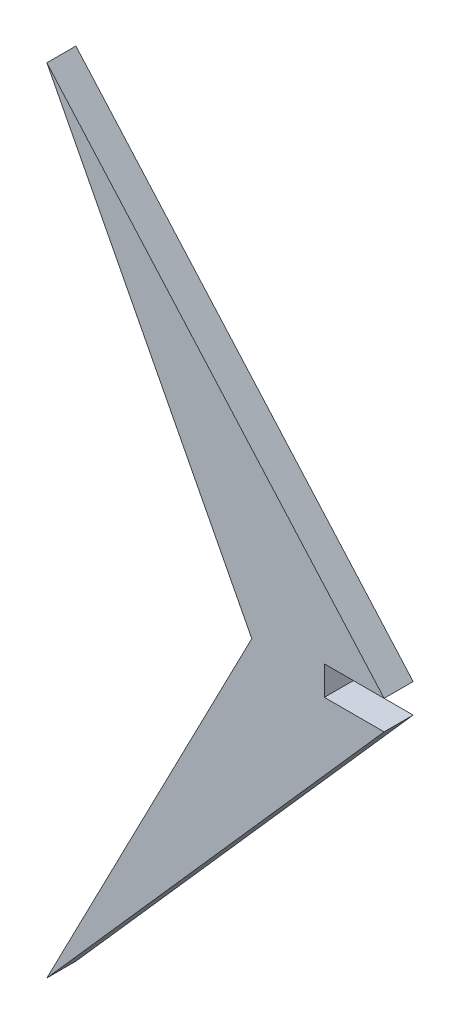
ISO-10303-21;
HEADER;
FILE_DESCRIPTION(('STEP AP214'),'2;1');
FILE_NAME('part.step','',(''),(''),'','','');
FILE_SCHEMA(('AUTOMOTIVE_DESIGN { 1 0 10303 214 1 1 1 1 }'));
ENDSEC;
DATA;
#1=APPLICATION_CONTEXT('core data for automotive mechanical design processes');
#2=APPLICATION_PROTOCOL_DEFINITION('international standard','automotive_design',2000,#1);
#3=PRODUCT_CONTEXT('',#1,'mechanical');
#4=PRODUCT('Part','Part','',(#3));
#5=PRODUCT_RELATED_PRODUCT_CATEGORY('part','',(#4));
#6=PRODUCT_DEFINITION_FORMATION('','',#4);
#7=PRODUCT_DEFINITION_CONTEXT('part definition',#1,'design');
#8=PRODUCT_DEFINITION('design','',#6,#7);
#9=PRODUCT_DEFINITION_SHAPE('','',#8);
#10=(LENGTH_UNIT() NAMED_UNIT(*) SI_UNIT(.MILLI.,.METRE.));
#11=(NAMED_UNIT(*) PLANE_ANGLE_UNIT() SI_UNIT($,.RADIAN.));
#12=(NAMED_UNIT(*) SI_UNIT($,.STERADIAN.) SOLID_ANGLE_UNIT());
#13=UNCERTAINTY_MEASURE_WITH_UNIT(LENGTH_MEASURE(1.E-05),#10,'distance_accuracy_value','');
#14=(GEOMETRIC_REPRESENTATION_CONTEXT(3) GLOBAL_UNCERTAINTY_ASSIGNED_CONTEXT((#13)) GLOBAL_UNIT_ASSIGNED_CONTEXT((#10,
#11,#12)) REPRESENTATION_CONTEXT('',''));
#15=CARTESIAN_POINT('',(0.,0.,0.));
#16=DIRECTION('',(0.,0.,1.));
#17=DIRECTION('',(1.,0.,0.));
#18=AXIS2_PLACEMENT_3D('',#15,#16,#17);
#19=CARTESIAN_POINT('',(212.350028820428,103.,6.));
#20=DIRECTION('',(-0.74947678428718,-0.662030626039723,0.));
#21=DIRECTION('',(0.662030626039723,-0.74947678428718,0.));
#22=AXIS2_PLACEMENT_3D('',#19,#20,#21);
#23=PLANE('',#22);
#24=DIRECTION('',(-0.662030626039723,0.74947678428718,0.));
#25=VECTOR('',#24,1.);
#26=CARTESIAN_POINT('',(212.350028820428,103.,0.));
#27=LINE('',#26,#25);
#28=CARTESIAN_POINT('',(212.350028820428,103.,0.));
#29=VERTEX_POINT('',#28);
#30=CARTESIAN_POINT('',(142.642356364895,181.915204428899,0.));
#31=VERTEX_POINT('',#30);
#32=EDGE_CURVE('E123',#29,#31,#27,.T.);
#33=ORIENTED_EDGE('',*,*,#32,.T.);
#34=DIRECTION('',(0.,0.,-1.));
#35=VECTOR('',#34,1.);
#36=CARTESIAN_POINT('',(142.642356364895,181.915204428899,6.));
#37=LINE('',#36,#35);
#38=CARTESIAN_POINT('',(142.642356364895,181.915204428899,6.));
#39=VERTEX_POINT('',#38);
#40=EDGE_CURVE('E11',#39,#31,#37,.T.);
#41=ORIENTED_EDGE('',*,*,#40,.F.);
#42=DIRECTION('',(-0.662030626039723,0.74947678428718,0.));
#43=VECTOR('',#42,1.);
#44=CARTESIAN_POINT('',(212.350028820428,103.,6.));
#45=LINE('',#44,#43);
#46=CARTESIAN_POINT('',(212.350028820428,103.,6.));
#47=VERTEX_POINT('',#46);
#48=EDGE_CURVE('E135',#47,#39,#45,.T.);
#49=ORIENTED_EDGE('',*,*,#48,.F.);
#50=DIRECTION('',(0.,0.,-1.));
#51=VECTOR('',#50,1.);
#52=CARTESIAN_POINT('',(212.350028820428,103.,6.));
#53=LINE('',#52,#51);
#54=EDGE_CURVE('E119',#47,#29,#53,.T.);
#55=ORIENTED_EDGE('',*,*,#54,.T.);
#56=EDGE_LOOP('',(#33,#41,#49,#55));
#57=FACE_BOUND('',#56,.T.);
#58=ADVANCED_FACE('F33',(#57),#23,.F.);
#59=CARTESIAN_POINT('',(142.642356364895,181.915204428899,6.));
#60=DIRECTION('',(0.888272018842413,0.459317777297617,0.));
#61=DIRECTION('',(-0.459317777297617,0.888272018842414,0.));
#62=AXIS2_PLACEMENT_3D('',#59,#60,#61);
#63=PLANE('',#62);
#64=DIRECTION('',(0.459317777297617,-0.888272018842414,0.));
#65=VECTOR('',#64,1.);
#66=CARTESIAN_POINT('',(142.642356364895,181.915204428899,0.));
#67=LINE('',#66,#65);
#68=CARTESIAN_POINT('',(185.,100.,0.));
#69=VERTEX_POINT('',#68);
#70=EDGE_CURVE('E126',#31,#69,#67,.T.);
#71=ORIENTED_EDGE('',*,*,#70,.T.);
#72=DIRECTION('',(0.,0.,-1.));
#73=VECTOR('',#72,1.);
#74=CARTESIAN_POINT('',(185.,100.,6.));
#75=LINE('',#74,#73);
#76=CARTESIAN_POINT('',(185.,100.,6.));
#77=VERTEX_POINT('',#76);
#78=EDGE_CURVE('E41',#77,#69,#75,.T.);
#79=ORIENTED_EDGE('',*,*,#78,.F.);
#80=DIRECTION('',(0.459317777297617,-0.888272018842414,0.));
#81=VECTOR('',#80,1.);
#82=CARTESIAN_POINT('',(142.642356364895,181.915204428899,6.));
#83=LINE('',#82,#81);
#84=EDGE_CURVE('E89',#39,#77,#83,.T.);
#85=ORIENTED_EDGE('',*,*,#84,.F.);
#86=ORIENTED_EDGE('',*,*,#40,.T.);
#87=EDGE_LOOP('',(#71,#79,#85,#86));
#88=FACE_BOUND('',#87,.T.);
#89=ADVANCED_FACE('F160',(#88),#63,.F.);
#90=CARTESIAN_POINT('',(185.,100.,6.));
#91=DIRECTION('',(0.888272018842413,-0.459317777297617,0.));
#92=DIRECTION('',(0.459317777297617,0.888272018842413,0.));
#93=AXIS2_PLACEMENT_3D('',#90,#91,#92);
#94=PLANE('',#93);
#95=DIRECTION('',(-0.459317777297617,-0.888272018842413,0.));
#96=VECTOR('',#95,1.);
#97=CARTESIAN_POINT('',(185.,100.,0.));
#98=LINE('',#97,#96);
#99=CARTESIAN_POINT('',(142.642356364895,18.0847955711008,0.));
#100=VERTEX_POINT('',#99);
#101=EDGE_CURVE('E128',#69,#100,#98,.T.);
#102=ORIENTED_EDGE('',*,*,#101,.T.);
#103=DIRECTION('',(0.,0.,-1.));
#104=VECTOR('',#103,1.);
#105=CARTESIAN_POINT('',(142.642356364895,18.0847955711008,6.));
#106=LINE('',#105,#104);
#107=CARTESIAN_POINT('',(142.642356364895,18.0847955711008,6.));
#108=VERTEX_POINT('',#107);
#109=EDGE_CURVE('E139',#108,#100,#106,.T.);
#110=ORIENTED_EDGE('',*,*,#109,.F.);
#111=DIRECTION('',(-0.459317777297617,-0.888272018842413,0.));
#112=VECTOR('',#111,1.);
#113=CARTESIAN_POINT('',(185.,100.,6.));
#114=LINE('',#113,#112);
#115=EDGE_CURVE('E147',#77,#108,#114,.T.);
#116=ORIENTED_EDGE('',*,*,#115,.F.);
#117=ORIENTED_EDGE('',*,*,#78,.T.);
#118=EDGE_LOOP('',(#102,#110,#116,#117));
#119=FACE_BOUND('',#118,.T.);
#120=ADVANCED_FACE('F145',(#119),#94,.F.);
#121=CARTESIAN_POINT('',(142.642356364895,18.0847955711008,6.));
#122=DIRECTION('',(-0.74947678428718,0.662030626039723,0.));
#123=DIRECTION('',(-0.662030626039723,-0.74947678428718,0.));
#124=AXIS2_PLACEMENT_3D('',#121,#122,#123);
#125=PLANE('',#124);
#126=DIRECTION('',(0.662030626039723,0.74947678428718,0.));
#127=VECTOR('',#126,1.);
#128=CARTESIAN_POINT('',(142.642356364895,18.0847955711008,0.));
#129=LINE('',#128,#127);
#130=CARTESIAN_POINT('',(212.350028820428,97.,0.));
#131=VERTEX_POINT('',#130);
#132=EDGE_CURVE('E130',#100,#131,#129,.T.);
#133=ORIENTED_EDGE('',*,*,#132,.T.);
#134=DIRECTION('',(0.,0.,-1.));
#135=VECTOR('',#134,1.);
#136=CARTESIAN_POINT('',(212.350028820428,97.,6.));
#137=LINE('',#136,#135);
#138=CARTESIAN_POINT('',(212.350028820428,97.,6.));
#139=VERTEX_POINT('',#138);
#140=EDGE_CURVE('E114',#139,#131,#137,.T.);
#141=ORIENTED_EDGE('',*,*,#140,.F.);
#142=DIRECTION('',(0.662030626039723,0.74947678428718,0.));
#143=VECTOR('',#142,1.);
#144=CARTESIAN_POINT('',(142.642356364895,18.0847955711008,6.));
#145=LINE('',#144,#143);
#146=EDGE_CURVE('E105',#108,#139,#145,.T.);
#147=ORIENTED_EDGE('',*,*,#146,.F.);
#148=ORIENTED_EDGE('',*,*,#109,.T.);
#149=EDGE_LOOP('',(#133,#141,#147,#148));
#150=FACE_BOUND('',#149,.T.);
#151=ADVANCED_FACE('F153',(#150),#125,.F.);
#152=CARTESIAN_POINT('',(200.,97.,6.));
#153=DIRECTION('',(0.,-1.,0.));
#154=DIRECTION('',(0.,0.,-1.));
#155=AXIS2_PLACEMENT_3D('',#152,#153,#154);
#156=PLANE('',#155);
#157=DIRECTION('',(-1.,0.,0.));
#158=VECTOR('',#157,1.);
#159=CARTESIAN_POINT('',(200.,97.,0.));
#160=LINE('',#159,#158);
#161=CARTESIAN_POINT('',(200.,97.,0.));
#162=VERTEX_POINT('',#161);
#163=EDGE_CURVE('E113',#131,#162,#160,.T.);
#164=ORIENTED_EDGE('',*,*,#163,.T.);
#165=DIRECTION('',(0.,0.,-1.));
#166=VECTOR('',#165,1.);
#167=CARTESIAN_POINT('',(200.,97.,6.));
#168=LINE('',#167,#166);
#169=CARTESIAN_POINT('',(200.,97.,6.));
#170=VERTEX_POINT('',#169);
#171=EDGE_CURVE('E110',#170,#162,#168,.T.);
#172=ORIENTED_EDGE('',*,*,#171,.F.);
#173=DIRECTION('',(-1.,0.,0.));
#174=VECTOR('',#173,1.);
#175=CARTESIAN_POINT('',(200.,97.,6.));
#176=LINE('',#175,#174);
#177=EDGE_CURVE('E99',#139,#170,#176,.T.);
#178=ORIENTED_EDGE('',*,*,#177,.F.);
#179=ORIENTED_EDGE('',*,*,#140,.T.);
#180=EDGE_LOOP('',(#164,#172,#178,#179));
#181=FACE_BOUND('',#180,.T.);
#182=ADVANCED_FACE('F111',(#181),#156,.F.);
#183=CARTESIAN_POINT('',(200.,97.,6.));
#184=DIRECTION('',(-1.,0.,0.));
#185=DIRECTION('',(0.,0.,1.));
#186=AXIS2_PLACEMENT_3D('',#183,#184,#185);
#187=PLANE('',#186);
#188=DIRECTION('',(0.,1.,0.));
#189=VECTOR('',#188,1.);
#190=CARTESIAN_POINT('',(200.,97.,0.));
#191=LINE('',#190,#189);
#192=CARTESIAN_POINT('',(200.,103.,0.));
#193=VERTEX_POINT('',#192);
#194=EDGE_CURVE('E75',#162,#193,#191,.T.);
#195=ORIENTED_EDGE('',*,*,#194,.T.);
#196=DIRECTION('',(0.,0.,-1.));
#197=VECTOR('',#196,1.);
#198=CARTESIAN_POINT('',(200.,103.,6.));
#199=LINE('',#198,#197);
#200=CARTESIAN_POINT('',(200.,103.,6.));
#201=VERTEX_POINT('',#200);
#202=EDGE_CURVE('E115',#201,#193,#199,.T.);
#203=ORIENTED_EDGE('',*,*,#202,.F.);
#204=DIRECTION('',(0.,1.,0.));
#205=VECTOR('',#204,1.);
#206=CARTESIAN_POINT('',(200.,97.,6.));
#207=LINE('',#206,#205);
#208=EDGE_CURVE('E103',#170,#201,#207,.T.);
#209=ORIENTED_EDGE('',*,*,#208,.F.);
#210=ORIENTED_EDGE('',*,*,#171,.T.);
#211=EDGE_LOOP('',(#195,#203,#209,#210));
#212=FACE_BOUND('',#211,.T.);
#213=ADVANCED_FACE('F117',(#212),#187,.F.);
#214=CARTESIAN_POINT('',(200.,103.,6.));
#215=DIRECTION('',(0.,1.,0.));
#216=DIRECTION('',(0.,0.,1.));
#217=AXIS2_PLACEMENT_3D('',#214,#215,#216);
#218=PLANE('',#217);
#219=DIRECTION('',(1.,0.,0.));
#220=VECTOR('',#219,1.);
#221=CARTESIAN_POINT('',(200.,103.,0.));
#222=LINE('',#221,#220);
#223=EDGE_CURVE('E81',#193,#29,#222,.T.);
#224=ORIENTED_EDGE('',*,*,#223,.T.);
#225=ORIENTED_EDGE('',*,*,#54,.F.);
#226=DIRECTION('',(1.,0.,0.));
#227=VECTOR('',#226,1.);
#228=CARTESIAN_POINT('',(200.,103.,6.));
#229=LINE('',#228,#227);
#230=EDGE_CURVE('E49',#201,#47,#229,.T.);
#231=ORIENTED_EDGE('',*,*,#230,.F.);
#232=ORIENTED_EDGE('',*,*,#202,.T.);
#233=EDGE_LOOP('',(#224,#225,#231,#232));
#234=FACE_BOUND('',#233,.T.);
#235=ADVANCED_FACE('F174',(#234),#218,.F.);
#236=CARTESIAN_POINT('',(0.,0.,6.));
#237=DIRECTION('',(0.,0.,-1.));
#238=DIRECTION('',(-1.,0.,0.));
#239=AXIS2_PLACEMENT_3D('',#236,#237,#238);
#240=PLANE('',#239);
#241=ORIENTED_EDGE('',*,*,#48,.T.);
#242=ORIENTED_EDGE('',*,*,#84,.T.);
#243=ORIENTED_EDGE('',*,*,#115,.T.);
#244=ORIENTED_EDGE('',*,*,#146,.T.);
#245=ORIENTED_EDGE('',*,*,#177,.T.);
#246=ORIENTED_EDGE('',*,*,#208,.T.);
#247=ORIENTED_EDGE('',*,*,#230,.T.);
#248=EDGE_LOOP('',(#241,#242,#243,#244,#245,#246,#247));
#249=FACE_BOUND('',#248,.T.);
#250=ADVANCED_FACE('F101',(#249),#240,.F.);
#251=CARTESIAN_POINT('',(0.,0.,0.));
#252=DIRECTION('',(0.,0.,-1.));
#253=DIRECTION('',(-1.,0.,0.));
#254=AXIS2_PLACEMENT_3D('',#251,#252,#253);
#255=PLANE('',#254);
#256=ORIENTED_EDGE('',*,*,#32,.F.);
#257=ORIENTED_EDGE('',*,*,#223,.F.);
#258=ORIENTED_EDGE('',*,*,#194,.F.);
#259=ORIENTED_EDGE('',*,*,#163,.F.);
#260=ORIENTED_EDGE('',*,*,#132,.F.);
#261=ORIENTED_EDGE('',*,*,#101,.F.);
#262=ORIENTED_EDGE('',*,*,#70,.F.);
#263=EDGE_LOOP('',(#256,#257,#258,#259,#260,#261,#262));
#264=FACE_BOUND('',#263,.T.);
#265=ADVANCED_FACE('F151',(#264),#255,.T.);
#266=CLOSED_SHELL('',(#58,#89,#120,#151,#182,#213,#235,#250,#265));
#267=MANIFOLD_SOLID_BREP('B2',#266);
#268=ADVANCED_BREP_SHAPE_REPRESENTATION('',(#18,#267),#14);
#269=SHAPE_DEFINITION_REPRESENTATION(#9,#268);
ENDSEC;
END-ISO-10303-21;
